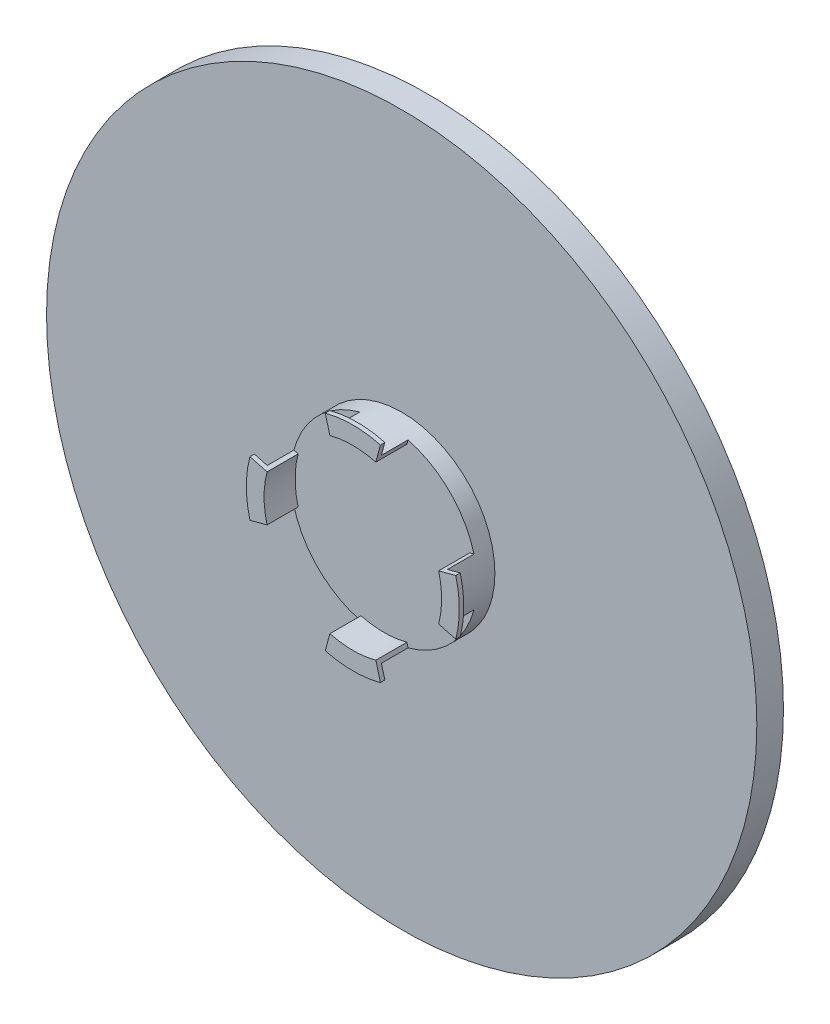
from build123d import *
from build123d.topology import SkipClean

# Parameters (mm, degrees)
ESQUISSE1_R      = 400
EXTRUSION1_DEPTH = 30
ESQUISSE3_R      = 105
EXTRUSION2_DEPTH = 20
EXTRUSION3_DEPTH = 30
EXTRUSION5_DEPTH = 5


with BuildPart() as part:
    # Esquisse1 → Extrusion1 (new body)
    with BuildSketch(Plane.XY):
        Circle(ESQUISSE1_R)
    extrude(amount=EXTRUSION1_DEPTH)

    # Esquisse3 → Extrusion2 (add)
    with BuildSketch(Plane.XY.offset(30)):
        Circle(ESQUISSE3_R)
    extrude(amount=EXTRUSION2_DEPTH)

    # Esquisse4 → Extrusion3 (add)
    with SkipClean():  # the faces are left unmerged after this step: merging them gives an invalid solid
        with BuildSketch(Plane.XY.offset(50)):
            with BuildLine():
                Line((-25.88190451, 96.592582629), (-27.175999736, 101.42221176))
                ThreePointArc((-27.175999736, 101.42221176), (0, 105), (27.175999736, 101.42221176))
                Line((27.175999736, 101.42221176), (25.88190451, 96.592582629))
                ThreePointArc((25.88190451, 96.592582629), (0, 100), (-25.88190451, 96.592582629))
            make_face()
            with BuildLine():
                Line((96.592582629, 25.88190451), (101.42221176, 27.175999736))
                ThreePointArc((101.42221176, 27.175999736), (105, 0), (101.42221176, -27.175999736))
                Line((101.42221176, -27.175999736), (96.592582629, -25.88190451))
                ThreePointArc((96.592582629, -25.88190451), (100, 0), (96.592582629, 25.88190451))
            make_face()
            with BuildLine():
                Line((-25.88190451, -96.592582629), (-27.175999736, -101.42221176))
                ThreePointArc((-27.175999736, -101.42221176), (0, -105), (27.175999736, -101.42221176))
                Line((27.175999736, -101.42221176), (25.88190451, -96.592582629))
                ThreePointArc((25.88190451, -96.592582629), (0, -100), (-25.88190451, -96.592582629))
            make_face()
            with BuildLine():
                Line((-96.592582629, 25.88190451), (-101.42221176, 27.175999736))
                ThreePointArc((-101.42221176, 27.175999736), (-105, 0), (-101.42221176, -27.175999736))
                Line((-101.42221176, -27.175999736), (-96.592582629, -25.88190451))
                ThreePointArc((-96.592582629, -25.88190451), (-100, 0), (-96.592582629, 25.88190451))
            make_face()
        extrude(amount=EXTRUSION3_DEPTH)

    # Esquisse6 → Extrusion5 (add)
    with SkipClean():  # the faces are left unmerged after this step: merging them gives an invalid solid
        with BuildSketch(Plane.XY.offset(80)):
            with BuildLine():
                Line((-25.88190451, 96.592582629), (-31.058285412, 115.911099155))
                ThreePointArc((-31.058285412, 115.911099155), (0, 120), (31.058285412, 115.911099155))
                Line((31.058285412, 115.911099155), (25.88190451, 96.592582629))
                ThreePointArc((25.88190451, 96.592582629), (0, 100), (-25.88190451, 96.592582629))
            make_face()
            with BuildLine():
                Line((96.592582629, 25.88190451), (115.911099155, 31.058285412))
                ThreePointArc((115.911099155, 31.058285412), (120, 0), (115.911099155, -31.058285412))
                Line((115.911099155, -31.058285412), (96.592582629, -25.88190451))
                ThreePointArc((96.592582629, -25.88190451), (100, 0), (96.592582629, 25.88190451))
            make_face()
            with BuildLine():
                Line((-96.592582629, 25.88190451), (-115.911099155, 31.058285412))
                ThreePointArc((-115.911099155, 31.058285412), (-120, 0), (-115.911099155, -31.058285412))
                Line((-115.911099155, -31.058285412), (-96.592582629, -25.88190451))
                ThreePointArc((-96.592582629, -25.88190451), (-100, 0), (-96.592582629, 25.88190451))
            make_face()
            with BuildLine():
                Line((-25.88190451, -96.592582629), (-31.058285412, -115.911099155))
                ThreePointArc((-31.058285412, -115.911099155), (0, -120), (31.058285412, -115.911099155))
                Line((31.058285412, -115.911099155), (25.88190451, -96.592582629))
                ThreePointArc((25.88190451, -96.592582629), (0, -100), (-25.88190451, -96.592582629))
            make_face()
        extrude(amount=EXTRUSION5_DEPTH)


solid = part.part
